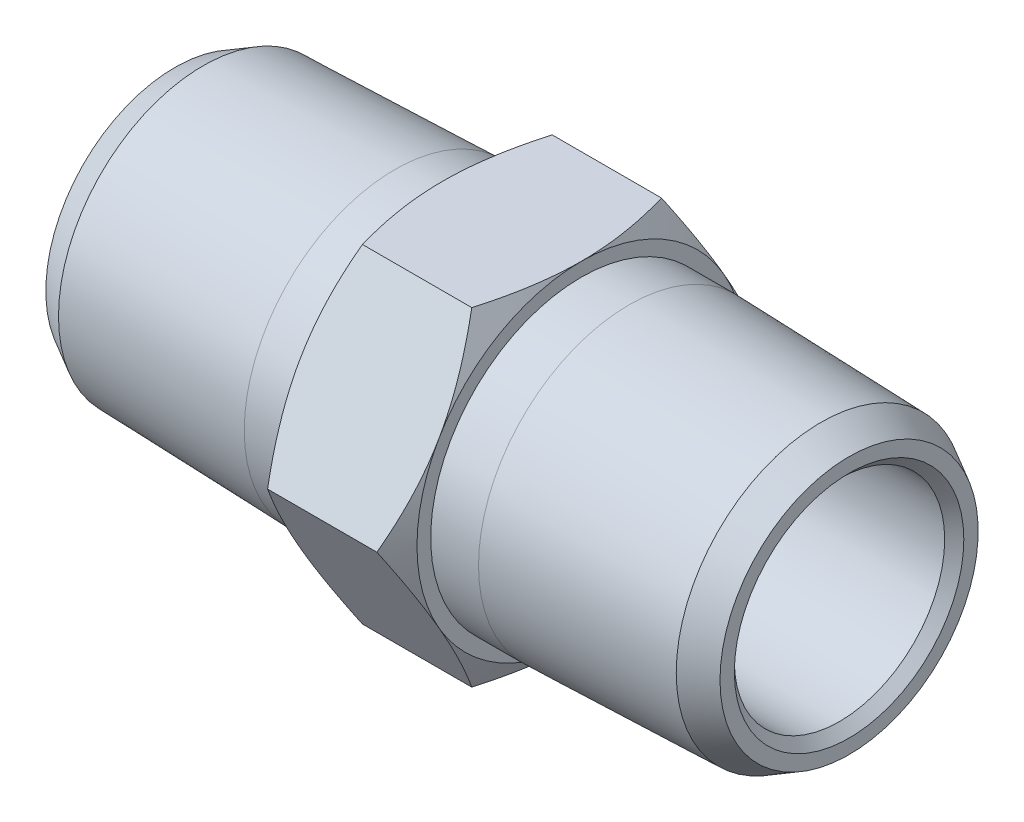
ISO-10303-21;
HEADER;
FILE_DESCRIPTION(('STEP AP214'),'2;1');
FILE_NAME('part.step','',(''),(''),'','','');
FILE_SCHEMA(('AUTOMOTIVE_DESIGN { 1 0 10303 214 1 1 1 1 }'));
ENDSEC;
DATA;
#1=APPLICATION_CONTEXT('core data for automotive mechanical design processes');
#2=APPLICATION_PROTOCOL_DEFINITION('international standard','automotive_design',2000,#1);
#3=PRODUCT_CONTEXT('',#1,'mechanical');
#4=PRODUCT('Part','Part','',(#3));
#5=PRODUCT_RELATED_PRODUCT_CATEGORY('part','',(#4));
#6=PRODUCT_DEFINITION_FORMATION('','',#4);
#7=PRODUCT_DEFINITION_CONTEXT('part definition',#1,'design');
#8=PRODUCT_DEFINITION('design','',#6,#7);
#9=PRODUCT_DEFINITION_SHAPE('','',#8);
#10=(LENGTH_UNIT() NAMED_UNIT(*) SI_UNIT(.MILLI.,.METRE.));
#11=(NAMED_UNIT(*) PLANE_ANGLE_UNIT() SI_UNIT($,.RADIAN.));
#12=(NAMED_UNIT(*) SI_UNIT($,.STERADIAN.) SOLID_ANGLE_UNIT());
#13=UNCERTAINTY_MEASURE_WITH_UNIT(LENGTH_MEASURE(1.E-05),#10,'distance_accuracy_value','');
#14=(GEOMETRIC_REPRESENTATION_CONTEXT(3) GLOBAL_UNCERTAINTY_ASSIGNED_CONTEXT((#13)) GLOBAL_UNIT_ASSIGNED_CONTEXT((#10,
#11,#12)) REPRESENTATION_CONTEXT('',''));
#15=CARTESIAN_POINT('',(0.,0.,0.));
#16=DIRECTION('',(0.,0.,1.));
#17=DIRECTION('',(1.,0.,0.));
#18=AXIS2_PLACEMENT_3D('',#15,#16,#17);
#19=CARTESIAN_POINT('',(0.,0.,-10.0819790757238));
#20=DIRECTION('',(0.,-0.5,-0.866025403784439));
#21=DIRECTION('',(0.,0.866025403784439,-0.5));
#22=AXIS2_PLACEMENT_3D('',#19,#20,#21);
#23=PLANE('',#22);
#24=CARTESIAN_POINT('',(-2.90315621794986,-2.16542185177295E-08,-10.0819790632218));
#25=CARTESIAN_POINT('',(-3.02163927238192,-0.355360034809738,-9.87681186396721));
#26=CARTESIAN_POINT('',(-3.13019043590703,-0.713565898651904,-9.67000161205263));
#27=CARTESIAN_POINT('',(-3.3216184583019,-1.43313517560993,-9.25455809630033));
#28=CARTESIAN_POINT('',(-3.40462227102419,-1.79447348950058,-9.04593932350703));
#29=CARTESIAN_POINT('',(-3.50653686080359,-2.33989111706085,-8.73104230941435));
#30=CARTESIAN_POINT('',(-3.536755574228,-2.52238597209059,-8.6256788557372));
#31=CARTESIAN_POINT('',(-3.58906479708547,-2.8882493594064,-8.41444753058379));
#32=CARTESIAN_POINT('',(-3.61115552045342,-3.07161786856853,-8.30857967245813));
#33=CARTESIAN_POINT('',(-3.64682062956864,-3.4399068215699,-8.09594794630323));
#34=CARTESIAN_POINT('',(-3.66035170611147,-3.62483043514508,-7.98918224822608));
#35=CARTESIAN_POINT('',(-3.67846012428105,-3.99504134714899,-7.77544087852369));
#36=CARTESIAN_POINT('',(-3.68303569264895,-4.18032871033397,-7.66846516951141));
#37=CARTESIAN_POINT('',(-3.68300000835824,-4.3656249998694,-7.56148430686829));
#38=B_SPLINE_CURVE_WITH_KNOTS('',3,(#24,#25,#26,#27,#28,#29,#30,#31,#32,#33,#34,#35,#36,#37),
.UNSPECIFIED.,.F.,.F.,(4,2,2,2,2,2,4),(0.,1.28181150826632,2.55714637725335,3.19565056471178,
3.83413794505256,4.47583056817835,5.1176502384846),.UNSPECIFIED.);
#39=CARTESIAN_POINT('',(-2.90315621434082,1.08271007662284E-08,-10.0819790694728));
#40=VERTEX_POINT('',#39);
#41=CARTESIAN_POINT('',(-3.68300000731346,-4.3656250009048,-7.56148430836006));
#42=VERTEX_POINT('',#41);
#43=EDGE_CURVE('E289',#40,#42,#38,.T.);
#44=ORIENTED_EDGE('',*,*,#43,.F.);
#45=DIRECTION('',(1.,0.,0.));
#46=VECTOR('',#45,1.);
#47=CARTESIAN_POINT('',(0.,0.,-10.0819790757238));
#48=LINE('',#47,#46);
#49=CARTESIAN_POINT('',(2.90315620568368,1.51443233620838E-08,-10.0819790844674));
#50=VERTEX_POINT('',#49);
#51=EDGE_CURVE('E134',#50,#40,#48,.F.);
#52=ORIENTED_EDGE('',*,*,#51,.F.);
#53=CARTESIAN_POINT('',(3.68300000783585,-4.3656249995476,-7.5614843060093));
#54=CARTESIAN_POINT('',(3.68303569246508,-4.18032870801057,-7.66846517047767));
#55=CARTESIAN_POINT('',(3.67846012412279,-3.99504134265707,-7.77544088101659));
#56=CARTESIAN_POINT('',(3.66035170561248,-3.62483042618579,-7.98918225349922));
#57=CARTESIAN_POINT('',(3.64682062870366,-3.43990681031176,-8.09594795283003));
#58=CARTESIAN_POINT('',(3.61115551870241,-3.07161785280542,-8.30857968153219));
#59=CARTESIAN_POINT('',(3.58906479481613,-2.8882493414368,-8.41444754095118));
#60=CARTESIAN_POINT('',(3.53675557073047,-2.52238594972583,-8.62567886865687));
#61=CARTESIAN_POINT('',(3.50653685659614,-2.33989109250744,-8.73104232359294));
#62=CARTESIAN_POINT('',(3.4046222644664,-1.79447345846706,-9.0459393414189));
#63=CARTESIAN_POINT('',(3.32161844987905,-1.43313514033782,-9.25455811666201));
#64=CARTESIAN_POINT('',(3.13019042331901,-0.713565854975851,-9.6700016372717));
#65=CARTESIAN_POINT('',(3.02163925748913,-0.355359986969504,-9.87681189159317));
#66=CARTESIAN_POINT('',(2.90315620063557,3.02886534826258E-08,-10.081979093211));
#67=B_SPLINE_CURVE_WITH_KNOTS('',3,(#53,#54,#55,#56,#57,#58,#59,#60,#61,#62,#63,#64,#65,#66),
.UNSPECIFIED.,.F.,.F.,(4,2,2,2,2,2,4),(0.,0.641819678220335,1.28351230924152,1.92199969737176,
2.56050389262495,3.83583877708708,5.11765030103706),.UNSPECIFIED.);
#68=CARTESIAN_POINT('',(3.68300000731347,-4.3656250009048,-7.56148430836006));
#69=VERTEX_POINT('',#68);
#70=EDGE_CURVE('E132',#69,#50,#67,.T.);
#71=ORIENTED_EDGE('',*,*,#70,.F.);
#72=CARTESIAN_POINT('',(2.90315623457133,-8.73124992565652,-5.04098957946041));
#73=CARTESIAN_POINT('',(3.02163928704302,-8.37588991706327,-5.2461567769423));
#74=CARTESIAN_POINT('',(3.1301904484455,-8.01768405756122,-5.45296702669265));
#75=CARTESIAN_POINT('',(3.32161846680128,-7.29811478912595,-5.86841053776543));
#76=CARTESIAN_POINT('',(3.4046222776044,-6.93677647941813,-6.07702930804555));
#77=CARTESIAN_POINT('',(3.50653686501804,-6.39135885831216,-6.39192631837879));
#78=CARTESIAN_POINT('',(3.53675557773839,-6.20886400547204,-6.49728977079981));
#79=CARTESIAN_POINT('',(3.58906479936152,-5.84300062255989,-6.70852109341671));
#80=CARTESIAN_POINT('',(3.61115552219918,-5.6596321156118,-6.81438895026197));
#81=CARTESIAN_POINT('',(3.64682063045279,-5.29134316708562,-7.02702067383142));
#82=CARTESIAN_POINT('',(3.66035170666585,-5.10641955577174,-7.13378637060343));
#83=CARTESIAN_POINT('',(3.67846012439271,-4.73620864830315,-7.34752773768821));
#84=CARTESIAN_POINT('',(3.68303569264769,-4.55092128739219,-7.45450344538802));
#85=CARTESIAN_POINT('',(3.68300000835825,-4.3656250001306,-7.56148430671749));
#86=B_SPLINE_CURVE_WITH_KNOTS('',3,(#72,#73,#74,#75,#76,#77,#78,#79,#80,#81,#82,#83,#84,#85),
.UNSPECIFIED.,.F.,.F.,(4,2,2,2,2,2,4),(0.,1.28181149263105,2.55714634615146,3.19565052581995,
3.83413789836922,4.47583051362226,5.11765017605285),.UNSPECIFIED.);
#87=CARTESIAN_POINT('',(2.90315620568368,-8.73125,-5.04098955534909));
#88=VERTEX_POINT('',#87);
#89=EDGE_CURVE('E20',#88,#69,#86,.T.);
#90=ORIENTED_EDGE('',*,*,#89,.F.);
#91=DIRECTION('',(1.,0.,0.));
#92=VECTOR('',#91,1.);
#93=CARTESIAN_POINT('',(0.,-8.73125,-5.04098953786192));
#94=LINE('',#93,#92);
#95=CARTESIAN_POINT('',(-2.90315622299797,-8.73124996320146,-5.04098955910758));
#96=VERTEX_POINT('',#95);
#97=EDGE_CURVE('E109',#96,#88,#94,.T.);
#98=ORIENTED_EDGE('',*,*,#97,.F.);
#99=CARTESIAN_POINT('',(-3.68300000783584,-4.3656249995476,-7.5614843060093));
#100=CARTESIAN_POINT('',(-3.68303569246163,-4.55092128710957,-7.45450344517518));
#101=CARTESIAN_POINT('',(-3.67846012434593,-4.73620864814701,-7.34752773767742));
#102=CARTESIAN_POINT('',(-3.66035170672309,-5.10641955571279,-7.13378637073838));
#103=CARTESIAN_POINT('',(-3.64682063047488,-5.29134316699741,-7.02702067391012));
#104=CARTESIAN_POINT('',(-3.61115552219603,-5.65963211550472,-6.81438895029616));
#105=CARTESIAN_POINT('',(-3.58906479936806,-5.84300062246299,-6.70852109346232));
#106=CARTESIAN_POINT('',(-3.53675557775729,-6.20886400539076,-6.49728977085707));
#107=CARTESIAN_POINT('',(-3.50653686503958,-6.39135885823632,-6.39192631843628));
#108=CARTESIAN_POINT('',(-3.40462227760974,-6.93677647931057,-6.07702930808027));
#109=CARTESIAN_POINT('',(-3.32161846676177,-7.29811478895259,-5.8684105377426));
#110=CARTESIAN_POINT('',(-3.13019044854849,-8.01768405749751,-5.45296702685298));
#111=CARTESIAN_POINT('',(-3.02163928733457,-8.37588991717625,-5.24615677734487));
#112=CARTESIAN_POINT('',(-2.90315623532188,-8.73124992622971,-5.04098958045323));
#113=B_SPLINE_CURVE_WITH_KNOTS('',3,(#99,#100,#101,#102,#103,#104,#105,#106,#107,#108,#109,#110,
#111,#112),.UNSPECIFIED.,.F.,.F.,(4,2,2,2,2,2,4),(0.,0.641819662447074,1.28351227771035,
1.9219996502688,2.56050382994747,3.83583868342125,5.11765017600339),.UNSPECIFIED.);
#114=EDGE_CURVE('E192',#42,#96,#113,.T.);
#115=ORIENTED_EDGE('',*,*,#114,.F.);
#116=EDGE_LOOP('',(#44,#52,#71,#90,#98,#115));
#117=FACE_BOUND('',#116,.T.);
#118=ADVANCED_FACE('F16',(#117),#23,.T.);
#119=CARTESIAN_POINT('',(0.,8.73125,-5.04098953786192));
#120=DIRECTION('',(0.,0.5,-0.866025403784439));
#121=DIRECTION('',(0.,0.866025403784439,0.5));
#122=AXIS2_PLACEMENT_3D('',#119,#120,#121);
#123=PLANE('',#122);
#124=CARTESIAN_POINT('',(-2.90315620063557,8.73125003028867,-5.04098952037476));
#125=CARTESIAN_POINT('',(-3.02163925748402,8.37589001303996,-5.24615672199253));
#126=CARTESIAN_POINT('',(-3.13019042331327,8.01768414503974,-5.45296697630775));
#127=CARTESIAN_POINT('',(-3.32161844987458,7.29811485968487,-5.86841049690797));
#128=CARTESIAN_POINT('',(-3.40462226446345,6.9367765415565,-6.07702927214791));
#129=CARTESIAN_POINT('',(-3.50653685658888,6.39135890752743,-6.39192628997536));
#130=CARTESIAN_POINT('',(-3.53675557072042,6.20886405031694,-6.49728974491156));
#131=CARTESIAN_POINT('',(-3.58906479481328,5.84300065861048,-6.70852107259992));
#132=CARTESIAN_POINT('',(-3.6111555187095,5.65963214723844,-6.81438893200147));
#133=CARTESIAN_POINT('',(-3.64682062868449,5.29134318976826,-7.02702066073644));
#134=CARTESIAN_POINT('',(-3.66035170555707,5.10641957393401,-7.13378636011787));
#135=CARTESIAN_POINT('',(-3.67846012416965,4.73620865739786,-7.34752773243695));
#136=CARTESIAN_POINT('',(-3.68303569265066,4.55092129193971,-7.45450344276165));
#137=CARTESIAN_POINT('',(-3.68300000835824,4.36562500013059,-7.56148430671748));
#138=B_SPLINE_CURVE_WITH_KNOTS('',3,(#124,#125,#126,#127,#128,#129,#130,#131,#132,#133,#134,
#135,#136,#137),.UNSPECIFIED.,.F.,.F.,(4,2,2,2,2,2,4),(0.,1.28181152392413,2.55714640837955,
3.19565060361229,3.834137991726,4.47583062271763,5.11765030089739),.UNSPECIFIED.);
#139=CARTESIAN_POINT('',(-2.90315622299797,8.73125,-5.04098949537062));
#140=VERTEX_POINT('',#139);
#141=CARTESIAN_POINT('',(-3.68300000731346,4.3656250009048,-7.56148430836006));
#142=VERTEX_POINT('',#141);
#143=EDGE_CURVE('E278',#140,#142,#138,.T.);
#144=ORIENTED_EDGE('',*,*,#143,.F.);
#145=DIRECTION('',(1.,0.,0.));
#146=VECTOR('',#145,1.);
#147=CARTESIAN_POINT('',(0.,8.73125,-5.04098953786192));
#148=LINE('',#147,#146);
#149=CARTESIAN_POINT('',(2.90315620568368,8.73125001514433,-5.04098952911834));
#150=VERTEX_POINT('',#149);
#151=EDGE_CURVE('E394',#150,#140,#148,.F.);
#152=ORIENTED_EDGE('',*,*,#151,.F.);
#153=CARTESIAN_POINT('',(3.68300000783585,4.3656249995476,-7.5614843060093));
#154=CARTESIAN_POINT('',(3.68303569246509,4.55092129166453,-7.45450344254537));
#155=CARTESIAN_POINT('',(3.67846012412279,4.73620865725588,-7.34752773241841));
#156=CARTESIAN_POINT('',(3.66035170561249,5.10641957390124,-7.13378636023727));
#157=CARTESIAN_POINT('',(3.64682062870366,5.29134318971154,-7.0270206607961));
#158=CARTESIAN_POINT('',(3.61115551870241,5.65963214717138,-6.8143889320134));
#159=CARTESIAN_POINT('',(3.58906479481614,5.84300065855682,-6.70852107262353));
#160=CARTESIAN_POINT('',(3.53675557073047,6.20886405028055,-6.49728974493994));
#161=CARTESIAN_POINT('',(3.50653685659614,6.39135890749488,-6.39192628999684));
#162=CARTESIAN_POINT('',(3.40462226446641,6.93677654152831,-6.07702927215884));
#163=CARTESIAN_POINT('',(3.32161844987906,7.29811485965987,-5.86841049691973));
#164=CARTESIAN_POINT('',(3.13019042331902,8.01768414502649,-5.4529669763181));
#165=CARTESIAN_POINT('',(3.02163925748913,8.37589001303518,-5.24615672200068));
#166=CARTESIAN_POINT('',(2.90315620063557,8.73125003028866,-5.04098952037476));
#167=B_SPLINE_CURVE_WITH_KNOTS('',3,(#153,#154,#155,#156,#157,#158,#159,#160,#161,#162,#163,
#164,#165,#166),.UNSPECIFIED.,.F.,.F.,(4,2,2,2,2,2,4),(0.,0.641819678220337,1.28351230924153,
1.92199969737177,2.56050389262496,3.8358387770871,5.11765030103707),.UNSPECIFIED.);
#168=CARTESIAN_POINT('',(3.68300000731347,4.3656250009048,-7.56148430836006));
#169=VERTEX_POINT('',#168);
#170=EDGE_CURVE('E327',#169,#150,#167,.T.);
#171=ORIENTED_EDGE('',*,*,#170,.F.);
#172=CARTESIAN_POINT('',(2.90315623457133,7.31970769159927E-08,-10.0819790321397));
#173=CARTESIAN_POINT('',(3.02163928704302,0.355360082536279,-9.87681183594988));
#174=CARTESIAN_POINT('',(3.13019044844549,0.713565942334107,-9.67000158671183));
#175=CARTESIAN_POINT('',(3.32161846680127,1.43313521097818,-9.2545580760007));
#176=CARTESIAN_POINT('',(3.40462227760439,1.79447352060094,-9.04593930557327));
#177=CARTESIAN_POINT('',(3.50653686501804,2.33989114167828,-8.73104229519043));
#178=CARTESIAN_POINT('',(3.53675557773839,2.52238599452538,-8.62567884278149));
#179=CARTESIAN_POINT('',(3.58906479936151,2.88824937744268,-8.41444752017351));
#180=CARTESIAN_POINT('',(3.61115552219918,3.07161788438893,-8.30857966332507));
#181=CARTESIAN_POINT('',(3.64682063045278,3.43990683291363,-8.09594793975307));
#182=CARTESIAN_POINT('',(3.66035170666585,3.62483044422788,-7.98918224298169));
#183=CARTESIAN_POINT('',(3.6784601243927,3.99504135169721,-7.77544087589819));
#184=CARTESIAN_POINT('',(3.68303569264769,4.18032871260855,-7.66846516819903));
#185=CARTESIAN_POINT('',(3.68300000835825,4.3656249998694,-7.56148430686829));
#186=B_SPLINE_CURVE_WITH_KNOTS('',3,(#172,#173,#174,#175,#176,#177,#178,#179,#180,#181,#182,
#183,#184,#185),.UNSPECIFIED.,.F.,.F.,(4,2,2,2,2,2,4),(0.,1.28181149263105,2.55714634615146,
3.19565052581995,3.83413789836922,4.47583051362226,5.11765017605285),.UNSPECIFIED.);
#187=EDGE_CURVE('E128',#50,#169,#186,.T.);
#188=ORIENTED_EDGE('',*,*,#187,.F.);
#189=ORIENTED_EDGE('',*,*,#51,.T.);
#190=CARTESIAN_POINT('',(-3.68300000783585,4.3656249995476,-7.5614843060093));
#191=CARTESIAN_POINT('',(-3.68303569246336,4.18032871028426,-7.66846516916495));
#192=CARTESIAN_POINT('',(-3.67846012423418,3.99504134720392,-7.77544087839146));
#193=CARTESIAN_POINT('',(-3.66035170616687,3.62483043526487,-7.98918224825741));
#194=CARTESIAN_POINT('',(-3.6468206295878,3.43990682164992,-8.09594794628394));
#195=CARTESIAN_POINT('',(-3.61115552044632,3.0716178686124,-8.30857967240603));
#196=CARTESIAN_POINT('',(-3.58906479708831,2.88824935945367,-8.41444753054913));
#197=CARTESIAN_POINT('',(-3.53675557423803,2.52238597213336,-8.62567885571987));
#198=CARTESIAN_POINT('',(-3.50653686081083,2.33989111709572,-8.73104230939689));
#199=CARTESIAN_POINT('',(-3.40462227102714,1.79447348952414,-9.04593932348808));
#200=CARTESIAN_POINT('',(-3.32161845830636,1.4331351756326,-9.25455809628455));
#201=CARTESIAN_POINT('',(-3.13019043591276,0.713565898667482,-9.67000161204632));
#202=CARTESIAN_POINT('',(-3.02163927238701,0.35536003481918,-9.87681186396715));
#203=CARTESIAN_POINT('',(-2.90315621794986,2.16542089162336E-08,-10.0819790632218));
#204=B_SPLINE_CURVE_WITH_KNOTS('',3,(#190,#191,#192,#193,#194,#195,#196,#197,#198,#199,#200,
#201,#202,#203),.UNSPECIFIED.,.F.,.F.,(4,2,2,2,2,2,4),(0.,0.641819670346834,1.28351229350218,
1.92199967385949,2.56050386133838,3.83583873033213,5.1176502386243),.UNSPECIFIED.);
#205=EDGE_CURVE('E293',#142,#40,#204,.T.);
#206=ORIENTED_EDGE('',*,*,#205,.F.);
#207=EDGE_LOOP('',(#144,#152,#171,#188,#189,#206));
#208=FACE_BOUND('',#207,.T.);
#209=ADVANCED_FACE('F300',(#208),#123,.T.);
#210=CARTESIAN_POINT('',(0.,8.73125,5.04098953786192));
#211=DIRECTION('',(0.,1.,0.));
#212=DIRECTION('',(0.,0.,1.));
#213=AXIS2_PLACEMENT_3D('',#210,#211,#212);
#214=PLANE('',#213);
#215=CARTESIAN_POINT('',(-2.90315623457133,8.7312499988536,5.04098945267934));
#216=CARTESIAN_POINT('',(-3.02163928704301,8.73124999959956,4.63065505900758));
#217=CARTESIAN_POINT('',(-3.13019044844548,8.73124999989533,4.21703456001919));
#218=CARTESIAN_POINT('',(-3.32161846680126,8.73125000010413,3.38614753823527));
#219=CARTESIAN_POINT('',(-3.40462227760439,8.73125000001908,2.96890999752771));
#220=CARTESIAN_POINT('',(-3.50653686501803,8.73124999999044,2.33911597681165));
#221=CARTESIAN_POINT('',(-3.53675557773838,8.73124999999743,2.12838907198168));
#222=CARTESIAN_POINT('',(-3.5890647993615,8.73125000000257,1.7059264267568));
#223=CARTESIAN_POINT('',(-3.61115552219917,8.73125000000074,1.49419071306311));
#224=CARTESIAN_POINT('',(-3.64682063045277,8.73124999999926,1.06892726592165));
#225=CARTESIAN_POINT('',(-3.66035170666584,8.73124999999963,0.855395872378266));
#226=CARTESIAN_POINT('',(-3.67846012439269,8.73125000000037,0.427913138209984));
#227=CARTESIAN_POINT('',(-3.68303569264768,8.73125000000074,0.213961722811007));
#228=CARTESIAN_POINT('',(-3.68300000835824,8.73125,1.50800647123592E-10));
#229=B_SPLINE_CURVE_WITH_KNOTS('',3,(#215,#216,#217,#218,#219,#220,#221,#222,#223,#224,#225,
#226,#227,#228),.UNSPECIFIED.,.F.,.F.,(4,2,2,2,2,2,4),(0.,1.28181149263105,2.55714634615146,
3.19565052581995,3.83413789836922,4.47583051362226,5.11765017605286),.UNSPECIFIED.);
#230=CARTESIAN_POINT('',(-2.90315620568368,8.73125001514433,5.04098952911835));
#231=VERTEX_POINT('',#230);
#232=CARTESIAN_POINT('',(-3.68300000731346,8.73125000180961,0.));
#233=VERTEX_POINT('',#232);
#234=EDGE_CURVE('E258',#231,#233,#229,.T.);
#235=ORIENTED_EDGE('',*,*,#234,.F.);
#236=DIRECTION('',(1.,0.,0.));
#237=VECTOR('',#236,1.);
#238=CARTESIAN_POINT('',(0.,8.73125,5.04098953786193));
#239=LINE('',#238,#237);
#240=CARTESIAN_POINT('',(2.90315622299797,8.73125,5.04098949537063));
#241=VERTEX_POINT('',#240);
#242=EDGE_CURVE('E396',#241,#231,#239,.F.);
#243=ORIENTED_EDGE('',*,*,#242,.F.);
#244=CARTESIAN_POINT('',(3.68300000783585,8.73124999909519,0.));
#245=CARTESIAN_POINT('',(3.68303569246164,8.73124999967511,0.213961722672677));
#246=CARTESIAN_POINT('',(3.67846012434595,8.73124999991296,0.427913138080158));
#247=CARTESIAN_POINT('',(3.66035170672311,8.73125000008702,0.855395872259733));
#248=CARTESIAN_POINT('',(3.6468206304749,8.73125000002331,1.06892726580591));
#249=CARTESIAN_POINT('',(3.61115552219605,8.73124999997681,1.49419071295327));
#250=CARTESIAN_POINT('',(3.58906479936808,8.73124999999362,1.70592642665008));
#251=CARTESIAN_POINT('',(3.5367555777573,8.73125000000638,2.12838907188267));
#252=CARTESIAN_POINT('',(3.50653686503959,8.73125000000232,2.33911597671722));
#253=CARTESIAN_POINT('',(3.40462227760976,8.73124999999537,2.96890999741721));
#254=CARTESIAN_POINT('',(3.32161846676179,8.73124999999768,3.38614753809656));
#255=CARTESIAN_POINT('',(3.1301904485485,8.73125000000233,4.21703455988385));
#256=CARTESIAN_POINT('',(3.02163928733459,8.73125000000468,4.63065505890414));
#257=CARTESIAN_POINT('',(2.90315623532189,8.73125,5.04098945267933));
#258=B_SPLINE_CURVE_WITH_KNOTS('',3,(#244,#245,#246,#247,#248,#249,#250,#251,#252,#253,#254,
#255,#256,#257),.UNSPECIFIED.,.F.,.F.,(4,2,2,2,2,2,4),(0.,0.641819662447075,1.28351227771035,
1.92199965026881,2.56050382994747,3.83583868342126,5.11765017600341),.UNSPECIFIED.);
#259=CARTESIAN_POINT('',(3.68300000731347,8.73125000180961,0.));
#260=VERTEX_POINT('',#259);
#261=EDGE_CURVE('E332',#260,#241,#258,.T.);
#262=ORIENTED_EDGE('',*,*,#261,.F.);
#263=CARTESIAN_POINT('',(2.90315623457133,8.7312499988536,-5.04098945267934));
#264=CARTESIAN_POINT('',(3.02163928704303,8.73124999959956,-4.63065505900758));
#265=CARTESIAN_POINT('',(3.1301904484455,8.73124999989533,-4.2170345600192));
#266=CARTESIAN_POINT('',(3.32161846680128,8.73125000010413,-3.38614753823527));
#267=CARTESIAN_POINT('',(3.4046222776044,8.73125000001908,-2.96890999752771));
#268=CARTESIAN_POINT('',(3.50653686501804,8.73124999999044,-2.33911597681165));
#269=CARTESIAN_POINT('',(3.53675557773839,8.73124999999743,-2.12838907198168));
#270=CARTESIAN_POINT('',(3.58906479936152,8.73125000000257,-1.7059264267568));
#271=CARTESIAN_POINT('',(3.61115552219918,8.73125000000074,-1.49419071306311));
#272=CARTESIAN_POINT('',(3.64682063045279,8.73124999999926,-1.06892726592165));
#273=CARTESIAN_POINT('',(3.66035170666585,8.73124999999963,-0.855395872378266));
#274=CARTESIAN_POINT('',(3.67846012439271,8.73125000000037,-0.427913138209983));
#275=CARTESIAN_POINT('',(3.68303569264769,8.73125000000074,-0.213961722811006));
#276=CARTESIAN_POINT('',(3.68300000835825,8.73125,-1.50799381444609E-10));
#277=B_SPLINE_CURVE_WITH_KNOTS('',3,(#263,#264,#265,#266,#267,#268,#269,#270,#271,#272,#273,
#274,#275,#276),.UNSPECIFIED.,.F.,.F.,(4,2,2,2,2,2,4),(0.,1.28181149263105,2.55714634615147,
3.19565052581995,3.83413789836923,4.47583051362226,5.11765017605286),.UNSPECIFIED.);
#278=EDGE_CURVE('E137',#150,#260,#277,.T.);
#279=ORIENTED_EDGE('',*,*,#278,.F.);
#280=ORIENTED_EDGE('',*,*,#151,.T.);
#281=CARTESIAN_POINT('',(-3.68300000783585,8.7312499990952,0.));
#282=CARTESIAN_POINT('',(-3.68303569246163,8.73124999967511,-0.213961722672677));
#283=CARTESIAN_POINT('',(-3.67846012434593,8.73124999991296,-0.427913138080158));
#284=CARTESIAN_POINT('',(-3.6603517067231,8.73125000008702,-0.855395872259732));
#285=CARTESIAN_POINT('',(-3.64682063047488,8.73125000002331,-1.06892726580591));
#286=CARTESIAN_POINT('',(-3.61115552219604,8.73124999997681,-1.49419071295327));
#287=CARTESIAN_POINT('',(-3.58906479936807,8.73124999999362,-1.70592642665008));
#288=CARTESIAN_POINT('',(-3.53675557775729,8.73125000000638,-2.12838907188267));
#289=CARTESIAN_POINT('',(-3.50653686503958,8.73125000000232,-2.33911597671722));
#290=CARTESIAN_POINT('',(-3.40462227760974,8.73124999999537,-2.96890999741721));
#291=CARTESIAN_POINT('',(-3.32161846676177,8.73124999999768,-3.38614753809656));
#292=CARTESIAN_POINT('',(-3.13019044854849,8.73125000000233,-4.21703455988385));
#293=CARTESIAN_POINT('',(-3.02163928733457,8.73125000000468,-4.63065505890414));
#294=CARTESIAN_POINT('',(-2.90315623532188,8.73125,-5.04098945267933));
#295=B_SPLINE_CURVE_WITH_KNOTS('',3,(#281,#282,#283,#284,#285,#286,#287,#288,#289,#290,#291,
#292,#293,#294),.UNSPECIFIED.,.F.,.F.,(4,2,2,2,2,2,4),(0.,0.641819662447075,1.28351227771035,
1.92199965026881,2.56050382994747,3.83583868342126,5.11765017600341),.UNSPECIFIED.);
#296=EDGE_CURVE('E283',#233,#140,#295,.T.);
#297=ORIENTED_EDGE('',*,*,#296,.F.);
#298=EDGE_LOOP('',(#235,#243,#262,#279,#280,#297));
#299=FACE_BOUND('',#298,.T.);
#300=ADVANCED_FACE('F238',(#299),#214,.T.);
#301=CARTESIAN_POINT('',(0.,0.,10.0819790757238));
#302=DIRECTION('',(0.,0.5,0.866025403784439));
#303=DIRECTION('',(0.,-0.866025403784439,0.5));
#304=AXIS2_PLACEMENT_3D('',#301,#302,#303);
#305=PLANE('',#304);
#306=DIRECTION('',(1.,0.,0.));
#307=VECTOR('',#306,1.);
#308=CARTESIAN_POINT('',(0.,0.,10.0819790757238));
#309=LINE('',#308,#307);
#310=CARTESIAN_POINT('',(2.90315621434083,1.08271121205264E-08,10.0819790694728));
#311=VERTEX_POINT('',#310);
#312=CARTESIAN_POINT('',(-2.90315620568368,1.51443349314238E-08,10.0819790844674));
#313=VERTEX_POINT('',#312);
#314=EDGE_CURVE('E351',#311,#313,#309,.F.);
#315=ORIENTED_EDGE('',*,*,#314,.F.);
#316=CARTESIAN_POINT('',(3.68300000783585,4.3656249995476,7.56148430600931));
#317=CARTESIAN_POINT('',(3.68303569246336,4.18032871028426,7.66846516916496));
#318=CARTESIAN_POINT('',(3.67846012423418,3.99504134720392,7.77544087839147));
#319=CARTESIAN_POINT('',(3.66035170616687,3.62483043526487,7.98918224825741));
#320=CARTESIAN_POINT('',(3.6468206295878,3.43990682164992,8.09594794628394));
#321=CARTESIAN_POINT('',(3.61115552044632,3.0716178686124,8.30857967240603));
#322=CARTESIAN_POINT('',(3.58906479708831,2.88824935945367,8.41444753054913));
#323=CARTESIAN_POINT('',(3.53675557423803,2.52238597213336,8.62567885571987));
#324=CARTESIAN_POINT('',(3.50653686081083,2.33989111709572,8.73104230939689));
#325=CARTESIAN_POINT('',(3.40462227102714,1.79447348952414,9.04593932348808));
#326=CARTESIAN_POINT('',(3.32161845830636,1.4331351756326,9.25455809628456));
#327=CARTESIAN_POINT('',(3.13019043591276,0.713565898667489,9.67000161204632));
#328=CARTESIAN_POINT('',(3.02163927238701,0.355360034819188,9.87681186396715));
#329=CARTESIAN_POINT('',(2.90315621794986,2.16542181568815E-08,10.0819790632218));
#330=B_SPLINE_CURVE_WITH_KNOTS('',3,(#316,#317,#318,#319,#320,#321,#322,#323,#324,#325,#326,
#327,#328,#329),.UNSPECIFIED.,.F.,.F.,(4,2,2,2,2,2,4),(0.,0.641819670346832,1.28351229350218,
1.92199967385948,2.56050386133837,3.83583873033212,5.11765023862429),.UNSPECIFIED.);
#331=CARTESIAN_POINT('',(3.68300000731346,4.3656250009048,7.56148430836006));
#332=VERTEX_POINT('',#331);
#333=EDGE_CURVE('E224',#332,#311,#330,.T.);
#334=ORIENTED_EDGE('',*,*,#333,.F.);
#335=CARTESIAN_POINT('',(2.90315620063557,8.73125003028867,5.04098952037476));
#336=CARTESIAN_POINT('',(3.02163925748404,8.37589001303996,5.24615672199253));
#337=CARTESIAN_POINT('',(3.13019042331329,8.01768414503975,5.45296697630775));
#338=CARTESIAN_POINT('',(3.32161844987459,7.29811485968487,5.86841049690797));
#339=CARTESIAN_POINT('',(3.40462226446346,6.93677654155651,6.07702927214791));
#340=CARTESIAN_POINT('',(3.50653685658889,6.39135890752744,6.39192628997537));
#341=CARTESIAN_POINT('',(3.53675557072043,6.20886405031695,6.49728974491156));
#342=CARTESIAN_POINT('',(3.5890647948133,5.84300065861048,6.70852107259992));
#343=CARTESIAN_POINT('',(3.61115551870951,5.65963214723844,6.81438893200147));
#344=CARTESIAN_POINT('',(3.64682062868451,5.29134318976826,7.02702066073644));
#345=CARTESIAN_POINT('',(3.66035170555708,5.10641957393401,7.13378636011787));
#346=CARTESIAN_POINT('',(3.67846012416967,4.73620865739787,7.34752773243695));
#347=CARTESIAN_POINT('',(3.68303569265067,4.55092129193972,7.45450344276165));
#348=CARTESIAN_POINT('',(3.68300000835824,4.3656250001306,7.56148430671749));
#349=B_SPLINE_CURVE_WITH_KNOTS('',3,(#335,#336,#337,#338,#339,#340,#341,#342,#343,#344,#345,
#346,#347,#348),.UNSPECIFIED.,.F.,.F.,(4,2,2,2,2,2,4),(0.,1.28181152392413,2.55714640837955,
3.19565060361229,3.834137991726,4.47583062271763,5.11765030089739),.UNSPECIFIED.);
#350=EDGE_CURVE('E229',#241,#332,#349,.T.);
#351=ORIENTED_EDGE('',*,*,#350,.F.);
#352=ORIENTED_EDGE('',*,*,#242,.T.);
#353=CARTESIAN_POINT('',(-3.68300000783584,4.3656249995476,7.5614843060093));
#354=CARTESIAN_POINT('',(-3.68303569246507,4.55092129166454,7.45450344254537));
#355=CARTESIAN_POINT('',(-3.67846012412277,4.73620865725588,7.34752773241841));
#356=CARTESIAN_POINT('',(-3.66035170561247,5.10641957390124,7.13378636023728));
#357=CARTESIAN_POINT('',(-3.64682062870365,5.29134318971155,7.0270206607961));
#358=CARTESIAN_POINT('',(-3.6111555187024,5.65963214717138,6.81438893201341));
#359=CARTESIAN_POINT('',(-3.58906479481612,5.84300065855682,6.70852107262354));
#360=CARTESIAN_POINT('',(-3.53675557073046,6.20886405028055,6.49728974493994));
#361=CARTESIAN_POINT('',(-3.50653685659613,6.39135890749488,6.39192628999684));
#362=CARTESIAN_POINT('',(-3.40462226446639,6.93677654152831,6.07702927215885));
#363=CARTESIAN_POINT('',(-3.32161844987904,7.29811485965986,5.86841049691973));
#364=CARTESIAN_POINT('',(-3.130190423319,8.01768414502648,5.4529669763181));
#365=CARTESIAN_POINT('',(-3.02163925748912,8.37589001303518,5.24615672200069));
#366=CARTESIAN_POINT('',(-2.90315620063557,8.73125003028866,5.04098952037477));
#367=B_SPLINE_CURVE_WITH_KNOTS('',3,(#353,#354,#355,#356,#357,#358,#359,#360,#361,#362,#363,
#364,#365,#366),.UNSPECIFIED.,.F.,.F.,(4,2,2,2,2,2,4),(0.,0.641819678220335,1.28351230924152,
1.92199969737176,2.56050389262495,3.83583877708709,5.11765030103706),.UNSPECIFIED.);
#368=CARTESIAN_POINT('',(-3.68300000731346,4.36562500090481,7.56148430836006));
#369=VERTEX_POINT('',#368);
#370=EDGE_CURVE('E251',#369,#231,#367,.T.);
#371=ORIENTED_EDGE('',*,*,#370,.F.);
#372=CARTESIAN_POINT('',(-2.90315623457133,7.31970879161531E-08,10.0819790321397));
#373=CARTESIAN_POINT('',(-3.02163928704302,0.355360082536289,9.87681183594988));
#374=CARTESIAN_POINT('',(-3.13019044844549,0.713565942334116,9.67000158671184));
#375=CARTESIAN_POINT('',(-3.32161846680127,1.43313521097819,9.2545580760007));
#376=CARTESIAN_POINT('',(-3.40462227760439,1.79447352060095,9.04593930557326));
#377=CARTESIAN_POINT('',(-3.50653686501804,2.33989114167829,8.73104229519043));
#378=CARTESIAN_POINT('',(-3.53675557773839,2.52238599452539,8.62567884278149));
#379=CARTESIAN_POINT('',(-3.58906479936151,2.88824937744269,8.41444752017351));
#380=CARTESIAN_POINT('',(-3.61115552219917,3.07161788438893,8.30857966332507));
#381=CARTESIAN_POINT('',(-3.64682063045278,3.43990683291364,8.09594793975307));
#382=CARTESIAN_POINT('',(-3.66035170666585,3.62483044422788,7.98918224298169));
#383=CARTESIAN_POINT('',(-3.6784601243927,3.99504135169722,7.7754408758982));
#384=CARTESIAN_POINT('',(-3.68303569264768,4.18032871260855,7.66846516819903));
#385=CARTESIAN_POINT('',(-3.68300000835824,4.3656249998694,7.56148430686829));
#386=B_SPLINE_CURVE_WITH_KNOTS('',3,(#372,#373,#374,#375,#376,#377,#378,#379,#380,#381,#382,
#383,#384,#385),.UNSPECIFIED.,.F.,.F.,(4,2,2,2,2,2,4),(0.,1.28181149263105,2.55714634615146,
3.19565052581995,3.83413789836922,4.47583051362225,5.11765017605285),.UNSPECIFIED.);
#387=EDGE_CURVE('E246',#313,#369,#386,.T.);
#388=ORIENTED_EDGE('',*,*,#387,.F.);
#389=EDGE_LOOP('',(#315,#334,#351,#352,#371,#388));
#390=FACE_BOUND('',#389,.T.);
#391=ADVANCED_FACE('F234',(#390),#305,.T.);
#392=CARTESIAN_POINT('',(0.,-8.73125,5.04098953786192));
#393=DIRECTION('',(0.,-0.5,0.866025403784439));
#394=DIRECTION('',(0.,-0.866025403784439,-0.5));
#395=AXIS2_PLACEMENT_3D('',#392,#393,#394);
#396=PLANE('',#395);
#397=DIRECTION('',(1.,0.,0.));
#398=VECTOR('',#397,1.);
#399=CARTESIAN_POINT('',(0.,-8.73125,5.04098953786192));
#400=LINE('',#399,#398);
#401=CARTESIAN_POINT('',(2.90315622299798,-8.73124996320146,5.04098955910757));
#402=VERTEX_POINT('',#401);
#403=CARTESIAN_POINT('',(-2.90315620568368,-8.73125,5.04098955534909));
#404=VERTEX_POINT('',#403);
#405=EDGE_CURVE('E120',#402,#404,#400,.F.);
#406=ORIENTED_EDGE('',*,*,#405,.F.);
#407=CARTESIAN_POINT('',(3.68300000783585,-4.3656249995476,7.5614843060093));
#408=CARTESIAN_POINT('',(3.68303569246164,-4.55092128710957,7.45450344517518));
#409=CARTESIAN_POINT('',(3.67846012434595,-4.73620864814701,7.34752773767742));
#410=CARTESIAN_POINT('',(3.66035170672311,-5.10641955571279,7.13378637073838));
#411=CARTESIAN_POINT('',(3.6468206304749,-5.29134316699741,7.02702067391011));
#412=CARTESIAN_POINT('',(3.61115552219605,-5.65963211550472,6.81438895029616));
#413=CARTESIAN_POINT('',(3.58906479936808,-5.84300062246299,6.70852109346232));
#414=CARTESIAN_POINT('',(3.5367555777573,-6.20886400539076,6.49728977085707));
#415=CARTESIAN_POINT('',(3.50653686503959,-6.39135885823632,6.39192631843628));
#416=CARTESIAN_POINT('',(3.40462227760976,-6.93677647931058,6.07702930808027));
#417=CARTESIAN_POINT('',(3.32161846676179,-7.29811478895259,5.86841053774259));
#418=CARTESIAN_POINT('',(3.1301904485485,-8.01768405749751,5.45296702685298));
#419=CARTESIAN_POINT('',(3.02163928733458,-8.37588991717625,5.24615677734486));
#420=CARTESIAN_POINT('',(2.90315623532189,-8.73124992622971,5.04098958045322));
#421=B_SPLINE_CURVE_WITH_KNOTS('',3,(#407,#408,#409,#410,#411,#412,#413,#414,#415,#416,#417,
#418,#419,#420),.UNSPECIFIED.,.F.,.F.,(4,2,2,2,2,2,4),(0.,0.641819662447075,1.28351227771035,
1.92199965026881,2.56050382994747,3.83583868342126,5.11765017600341),.UNSPECIFIED.);
#422=CARTESIAN_POINT('',(3.68300000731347,-4.3656250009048,7.56148430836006));
#423=VERTEX_POINT('',#422);
#424=EDGE_CURVE('E193',#423,#402,#421,.T.);
#425=ORIENTED_EDGE('',*,*,#424,.F.);
#426=CARTESIAN_POINT('',(2.90315621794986,-2.16542090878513E-08,10.0819790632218));
#427=CARTESIAN_POINT('',(3.02163927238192,-0.35536003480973,9.87681186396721));
#428=CARTESIAN_POINT('',(3.13019043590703,-0.713565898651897,9.67000161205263));
#429=CARTESIAN_POINT('',(3.3216184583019,-1.43313517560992,9.25455809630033));
#430=CARTESIAN_POINT('',(3.4046222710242,-1.79447348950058,9.04593932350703));
#431=CARTESIAN_POINT('',(3.50653686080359,-2.33989111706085,8.73104230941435));
#432=CARTESIAN_POINT('',(3.536755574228,-2.52238597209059,8.6256788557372));
#433=CARTESIAN_POINT('',(3.58906479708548,-2.8882493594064,8.41444753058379));
#434=CARTESIAN_POINT('',(3.61115552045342,-3.07161786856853,8.30857967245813));
#435=CARTESIAN_POINT('',(3.64682062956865,-3.4399068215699,8.09594794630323));
#436=CARTESIAN_POINT('',(3.66035170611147,-3.62483043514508,7.98918224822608));
#437=CARTESIAN_POINT('',(3.67846012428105,-3.99504134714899,7.77544087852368));
#438=CARTESIAN_POINT('',(3.68303569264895,-4.18032871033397,7.6684651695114));
#439=CARTESIAN_POINT('',(3.68300000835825,-4.3656249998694,7.56148430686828));
#440=B_SPLINE_CURVE_WITH_KNOTS('',3,(#426,#427,#428,#429,#430,#431,#432,#433,#434,#435,#436,
#437,#438,#439),.UNSPECIFIED.,.F.,.F.,(4,2,2,2,2,2,4),(0.,1.28181150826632,2.55714637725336,
3.19565056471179,3.83413794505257,4.47583056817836,5.11765023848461),.UNSPECIFIED.);
#441=EDGE_CURVE('E219',#311,#423,#440,.T.);
#442=ORIENTED_EDGE('',*,*,#441,.F.);
#443=ORIENTED_EDGE('',*,*,#314,.T.);
#444=CARTESIAN_POINT('',(-3.68300000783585,-4.3656249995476,7.5614843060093));
#445=CARTESIAN_POINT('',(-3.68303569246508,-4.18032870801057,7.66846517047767));
#446=CARTESIAN_POINT('',(-3.67846012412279,-3.99504134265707,7.77544088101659));
#447=CARTESIAN_POINT('',(-3.66035170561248,-3.62483042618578,7.98918225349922));
#448=CARTESIAN_POINT('',(-3.64682062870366,-3.43990681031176,8.09594795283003));
#449=CARTESIAN_POINT('',(-3.61115551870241,-3.07161785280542,8.30857968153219));
#450=CARTESIAN_POINT('',(-3.58906479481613,-2.88824934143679,8.41444754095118));
#451=CARTESIAN_POINT('',(-3.53675557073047,-2.52238594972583,8.62567886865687));
#452=CARTESIAN_POINT('',(-3.50653685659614,-2.33989109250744,8.73104232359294));
#453=CARTESIAN_POINT('',(-3.4046222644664,-1.79447345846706,9.0459393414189));
#454=CARTESIAN_POINT('',(-3.32161844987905,-1.43313514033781,9.25455811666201));
#455=CARTESIAN_POINT('',(-3.13019042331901,-0.713565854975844,9.6700016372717));
#456=CARTESIAN_POINT('',(-3.02163925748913,-0.355359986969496,9.87681189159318));
#457=CARTESIAN_POINT('',(-2.90315620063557,3.02886635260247E-08,10.081979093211));
#458=B_SPLINE_CURVE_WITH_KNOTS('',3,(#444,#445,#446,#447,#448,#449,#450,#451,#452,#453,#454,
#455,#456,#457),.UNSPECIFIED.,.F.,.F.,(4,2,2,2,2,2,4),(0.,0.641819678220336,1.28351230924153,
1.92199969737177,2.56050389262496,3.83583877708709,5.11765030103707),.UNSPECIFIED.);
#459=CARTESIAN_POINT('',(-3.68300000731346,-4.3656250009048,7.56148430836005));
#460=VERTEX_POINT('',#459);
#461=EDGE_CURVE('E687',#460,#313,#458,.T.);
#462=ORIENTED_EDGE('',*,*,#461,.F.);
#463=CARTESIAN_POINT('',(-2.90315623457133,-8.73124992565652,5.04098957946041));
#464=CARTESIAN_POINT('',(-3.02163928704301,-8.37588991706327,5.2461567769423));
#465=CARTESIAN_POINT('',(-3.13019044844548,-8.01768405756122,5.45296702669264));
#466=CARTESIAN_POINT('',(-3.32161846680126,-7.29811478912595,5.86841053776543));
#467=CARTESIAN_POINT('',(-3.40462227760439,-6.93677647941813,6.07702930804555));
#468=CARTESIAN_POINT('',(-3.50653686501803,-6.39135885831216,6.39192631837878));
#469=CARTESIAN_POINT('',(-3.53675557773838,-6.20886400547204,6.49728977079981));
#470=CARTESIAN_POINT('',(-3.5890647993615,-5.84300062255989,6.70852109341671));
#471=CARTESIAN_POINT('',(-3.61115552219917,-5.6596321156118,6.81438895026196));
#472=CARTESIAN_POINT('',(-3.64682063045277,-5.29134316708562,7.02702067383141));
#473=CARTESIAN_POINT('',(-3.66035170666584,-5.10641955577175,7.13378637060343));
#474=CARTESIAN_POINT('',(-3.67846012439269,-4.73620864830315,7.34752773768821));
#475=CARTESIAN_POINT('',(-3.68303569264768,-4.55092128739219,7.45450344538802));
#476=CARTESIAN_POINT('',(-3.68300000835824,-4.3656250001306,7.56148430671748));
#477=B_SPLINE_CURVE_WITH_KNOTS('',3,(#463,#464,#465,#466,#467,#468,#469,#470,#471,#472,#473,
#474,#475,#476),.UNSPECIFIED.,.F.,.F.,(4,2,2,2,2,2,4),(0.,1.28181149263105,2.55714634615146,
3.19565052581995,3.83413789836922,4.47583051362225,5.11765017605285),.UNSPECIFIED.);
#478=EDGE_CURVE('E40',#404,#460,#477,.T.);
#479=ORIENTED_EDGE('',*,*,#478,.F.);
#480=EDGE_LOOP('',(#406,#425,#442,#443,#462,#479));
#481=FACE_BOUND('',#480,.T.);
#482=ADVANCED_FACE('F170',(#481),#396,.T.);
#483=CARTESIAN_POINT('',(0.,-8.73125,-5.04098953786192));
#484=DIRECTION('',(0.,-1.,0.));
#485=DIRECTION('',(0.,0.,-1.));
#486=AXIS2_PLACEMENT_3D('',#483,#484,#485);
#487=PLANE('',#486);
#488=ORIENTED_EDGE('',*,*,#97,.T.);
#489=CARTESIAN_POINT('',(3.68300000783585,-8.73124999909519,0.));
#490=CARTESIAN_POINT('',(3.68303569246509,-8.73124999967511,-0.213961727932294));
#491=CARTESIAN_POINT('',(3.67846012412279,-8.73124999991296,-0.427913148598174));
#492=CARTESIAN_POINT('',(3.66035170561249,-8.73125000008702,-0.855395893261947));
#493=CARTESIAN_POINT('',(3.64682062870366,-8.73125000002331,-1.06892729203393));
#494=CARTESIAN_POINT('',(3.61115551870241,-8.73124999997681,-1.49419074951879));
#495=CARTESIAN_POINT('',(3.58906479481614,-8.73124999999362,-1.70592646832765));
#496=CARTESIAN_POINT('',(3.53675557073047,-8.73125000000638,-2.12838912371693));
#497=CARTESIAN_POINT('',(3.50653685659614,-8.73125000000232,-2.33911603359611));
#498=CARTESIAN_POINT('',(3.40462226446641,-8.73124999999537,-2.96891006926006));
#499=CARTESIAN_POINT('',(3.32161844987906,-8.73124999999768,-3.38614761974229));
#500=CARTESIAN_POINT('',(3.13019042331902,-8.73125000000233,-4.21703466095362));
#501=CARTESIAN_POINT('',(3.02163925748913,-8.73125000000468,-4.63065516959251));
#502=CARTESIAN_POINT('',(2.90315620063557,-8.73125,-5.04098957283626));
#503=B_SPLINE_CURVE_WITH_KNOTS('',3,(#489,#490,#491,#492,#493,#494,#495,#496,#497,#498,#499,
#500,#501,#502),.UNSPECIFIED.,.F.,.F.,(4,2,2,2,2,2,4),(0.,0.641819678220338,1.28351230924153,
1.92199969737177,2.56050389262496,3.8358387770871,5.11765030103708),.UNSPECIFIED.);
#504=CARTESIAN_POINT('',(3.68300000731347,-8.73125000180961,0.));
#505=VERTEX_POINT('',#504);
#506=EDGE_CURVE('E113',#505,#88,#503,.T.);
#507=ORIENTED_EDGE('',*,*,#506,.F.);
#508=CARTESIAN_POINT('',(2.90315620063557,-8.73125,5.04098957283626));
#509=CARTESIAN_POINT('',(3.02163925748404,-8.73125,4.63065516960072));
#510=CARTESIAN_POINT('',(3.13019042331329,-8.73125,4.21703466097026));
#511=CARTESIAN_POINT('',(3.32161844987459,-8.73125,3.38614761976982));
#512=CARTESIAN_POINT('',(3.40462226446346,-8.73125,2.96891006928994));
#513=CARTESIAN_POINT('',(3.5065368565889,-8.73125,2.33911603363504));
#514=CARTESIAN_POINT('',(3.53675557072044,-8.73125,2.12838912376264));
#515=CARTESIAN_POINT('',(3.5890647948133,-8.73125,1.70592646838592));
#516=CARTESIAN_POINT('',(3.61115551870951,-8.73125,1.49419074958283));
#517=CARTESIAN_POINT('',(3.64682062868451,-8.73125,1.06892729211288));
#518=CARTESIAN_POINT('',(3.66035170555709,-8.73125,0.85539589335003));
#519=CARTESIAN_POINT('',(3.67846012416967,-8.73125,0.427913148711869));
#520=CARTESIAN_POINT('',(3.68303569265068,-8.73125,0.213961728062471));
#521=CARTESIAN_POINT('',(3.68300000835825,-8.73125,1.50801693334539E-10));
#522=B_SPLINE_CURVE_WITH_KNOTS('',3,(#508,#509,#510,#511,#512,#513,#514,#515,#516,#517,#518,
#519,#520,#521),.UNSPECIFIED.,.F.,.F.,(4,2,2,2,2,2,4),(0.,1.28181152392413,2.55714640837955,
3.19565060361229,3.834137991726,4.47583062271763,5.11765030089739),.UNSPECIFIED.);
#523=EDGE_CURVE('E186',#402,#505,#522,.T.);
#524=ORIENTED_EDGE('',*,*,#523,.F.);
#525=ORIENTED_EDGE('',*,*,#405,.T.);
#526=CARTESIAN_POINT('',(-3.68300000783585,-8.7312499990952,0.));
#527=CARTESIAN_POINT('',(-3.68303569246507,-8.73124999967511,0.2139617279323));
#528=CARTESIAN_POINT('',(-3.67846012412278,-8.73124999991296,0.42791314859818));
#529=CARTESIAN_POINT('',(-3.66035170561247,-8.73125000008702,0.855395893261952));
#530=CARTESIAN_POINT('',(-3.64682062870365,-8.73125000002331,1.06892729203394));
#531=CARTESIAN_POINT('',(-3.6111555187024,-8.73124999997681,1.49419074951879));
#532=CARTESIAN_POINT('',(-3.58906479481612,-8.73124999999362,1.70592646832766));
#533=CARTESIAN_POINT('',(-3.53675557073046,-8.73125000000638,2.12838912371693));
#534=CARTESIAN_POINT('',(-3.50653685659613,-8.73125000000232,2.33911603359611));
#535=CARTESIAN_POINT('',(-3.40462226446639,-8.73124999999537,2.96891006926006));
#536=CARTESIAN_POINT('',(-3.32161844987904,-8.73124999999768,3.38614761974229));
#537=CARTESIAN_POINT('',(-3.130190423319,-8.73125000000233,4.21703466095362));
#538=CARTESIAN_POINT('',(-3.02163925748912,-8.73125000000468,4.63065516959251));
#539=CARTESIAN_POINT('',(-2.90315620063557,-8.73125,5.04098957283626));
#540=B_SPLINE_CURVE_WITH_KNOTS('',3,(#526,#527,#528,#529,#530,#531,#532,#533,#534,#535,#536,
#537,#538,#539),.UNSPECIFIED.,.F.,.F.,(4,2,2,2,2,2,4),(0.,0.641819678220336,1.28351230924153,
1.92199969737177,2.56050389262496,3.83583877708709,5.11765030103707),.UNSPECIFIED.);
#541=CARTESIAN_POINT('',(-3.68300000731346,-8.73125000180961,0.));
#542=VERTEX_POINT('',#541);
#543=EDGE_CURVE('E149',#542,#404,#540,.T.);
#544=ORIENTED_EDGE('',*,*,#543,.F.);
#545=CARTESIAN_POINT('',(-2.90315620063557,-8.73125,-5.04098957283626));
#546=CARTESIAN_POINT('',(-3.02163925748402,-8.73125,-4.63065516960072));
#547=CARTESIAN_POINT('',(-3.13019042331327,-8.73125,-4.21703466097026));
#548=CARTESIAN_POINT('',(-3.32161844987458,-8.73125,-3.38614761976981));
#549=CARTESIAN_POINT('',(-3.40462226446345,-8.73125,-2.96891006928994));
#550=CARTESIAN_POINT('',(-3.50653685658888,-8.73125,-2.33911603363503));
#551=CARTESIAN_POINT('',(-3.53675557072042,-8.73125,-2.12838912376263));
#552=CARTESIAN_POINT('',(-3.58906479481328,-8.73125,-1.70592646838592));
#553=CARTESIAN_POINT('',(-3.6111555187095,-8.73125,-1.49419074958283));
#554=CARTESIAN_POINT('',(-3.64682062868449,-8.73125,-1.06892729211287));
#555=CARTESIAN_POINT('',(-3.66035170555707,-8.73125,-0.855395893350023));
#556=CARTESIAN_POINT('',(-3.67846012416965,-8.73125,-0.427913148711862));
#557=CARTESIAN_POINT('',(-3.68303569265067,-8.73125,-0.213961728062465));
#558=CARTESIAN_POINT('',(-3.68300000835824,-8.73125,-1.5079513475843E-10));
#559=B_SPLINE_CURVE_WITH_KNOTS('',3,(#545,#546,#547,#548,#549,#550,#551,#552,#553,#554,#555,
#556,#557,#558),.UNSPECIFIED.,.F.,.F.,(4,2,2,2,2,2,4),(0.,1.28181152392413,2.55714640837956,
3.19565060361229,3.834137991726,4.47583062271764,5.11765030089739),.UNSPECIFIED.);
#560=EDGE_CURVE('E116',#96,#542,#559,.T.);
#561=ORIENTED_EDGE('',*,*,#560,.F.);
#562=EDGE_LOOP('',(#488,#507,#524,#525,#544,#561));
#563=FACE_BOUND('',#562,.T.);
#564=ADVANCED_FACE('F111',(#563),#487,.T.);
#565=CARTESIAN_POINT('',(2.89847714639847,0.,0.));
#566=DIRECTION('',(-1.,0.,0.));
#567=DIRECTION('',(0.,0.,1.));
#568=AXIS2_PLACEMENT_3D('',#565,#566,#567);
#569=CONICAL_SURFACE('',#568,10.0900834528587,1.04719755);
#570=CARTESIAN_POINT('',(3.68300000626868,0.,0.));
#571=DIRECTION('',(-1.,0.,0.));
#572=DIRECTION('',(0.,0.,1.));
#573=AXIS2_PLACEMENT_3D('',#570,#571,#572);
#574=CIRCLE('',#573,8.73125000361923);
#575=EDGE_CURVE('E127',#505,#69,#574,.F.);
#576=ORIENTED_EDGE('',*,*,#575,.F.);
#577=ORIENTED_EDGE('',*,*,#506,.T.);
#578=ORIENTED_EDGE('',*,*,#89,.T.);
#579=EDGE_LOOP('',(#576,#577,#578));
#580=FACE_BOUND('',#579,.T.);
#581=ADVANCED_FACE('F125',(#580),#569,.T.);
#582=CARTESIAN_POINT('',(2.89847714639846,0.,0.));
#583=DIRECTION('',(-1.,0.,0.));
#584=DIRECTION('',(0.,0.,1.));
#585=AXIS2_PLACEMENT_3D('',#582,#583,#584);
#586=CONICAL_SURFACE('',#585,10.0900834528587,1.04719755);
#587=CARTESIAN_POINT('',(3.68300000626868,0.,0.));
#588=DIRECTION('',(-1.,0.,0.));
#589=DIRECTION('',(0.,0.,1.));
#590=AXIS2_PLACEMENT_3D('',#587,#588,#589);
#591=CIRCLE('',#590,8.73125000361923);
#592=EDGE_CURVE('E140',#69,#169,#591,.F.);
#593=ORIENTED_EDGE('',*,*,#592,.F.);
#594=ORIENTED_EDGE('',*,*,#70,.T.);
#595=ORIENTED_EDGE('',*,*,#187,.T.);
#596=EDGE_LOOP('',(#593,#594,#595));
#597=FACE_BOUND('',#596,.T.);
#598=ADVANCED_FACE('F141',(#597),#586,.T.);
#599=CARTESIAN_POINT('',(2.89847714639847,0.,0.));
#600=DIRECTION('',(-1.,0.,0.));
#601=DIRECTION('',(0.,0.,1.));
#602=AXIS2_PLACEMENT_3D('',#599,#600,#601);
#603=CONICAL_SURFACE('',#602,10.0900834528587,1.04719755);
#604=CARTESIAN_POINT('',(3.68300000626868,0.,0.));
#605=DIRECTION('',(-1.,0.,0.));
#606=DIRECTION('',(0.,0.,1.));
#607=AXIS2_PLACEMENT_3D('',#604,#605,#606);
#608=CIRCLE('',#607,8.73125000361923);
#609=EDGE_CURVE('E145',#169,#260,#608,.F.);
#610=ORIENTED_EDGE('',*,*,#609,.F.);
#611=ORIENTED_EDGE('',*,*,#170,.T.);
#612=ORIENTED_EDGE('',*,*,#278,.T.);
#613=EDGE_LOOP('',(#610,#611,#612));
#614=FACE_BOUND('',#613,.T.);
#615=ADVANCED_FACE('F321',(#614),#603,.T.);
#616=CARTESIAN_POINT('',(2.89847714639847,0.,0.));
#617=DIRECTION('',(-1.,0.,0.));
#618=DIRECTION('',(0.,0.,1.));
#619=AXIS2_PLACEMENT_3D('',#616,#617,#618);
#620=CONICAL_SURFACE('',#619,10.0900834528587,1.04719755);
#621=ORIENTED_EDGE('',*,*,#350,.T.);
#622=CARTESIAN_POINT('',(3.68300000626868,0.,0.));
#623=DIRECTION('',(-1.,0.,0.));
#624=DIRECTION('',(0.,0.,1.));
#625=AXIS2_PLACEMENT_3D('',#622,#623,#624);
#626=CIRCLE('',#625,8.73125000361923);
#627=EDGE_CURVE('E147',#260,#332,#626,.F.);
#628=ORIENTED_EDGE('',*,*,#627,.F.);
#629=ORIENTED_EDGE('',*,*,#261,.T.);
#630=EDGE_LOOP('',(#621,#628,#629));
#631=FACE_BOUND('',#630,.T.);
#632=ADVANCED_FACE('F214',(#631),#620,.T.);
#633=CARTESIAN_POINT('',(2.89847714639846,0.,0.));
#634=DIRECTION('',(-1.,0.,0.));
#635=DIRECTION('',(0.,0.,1.));
#636=AXIS2_PLACEMENT_3D('',#633,#634,#635);
#637=CONICAL_SURFACE('',#636,10.0900834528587,1.04719755);
#638=ORIENTED_EDGE('',*,*,#441,.T.);
#639=CARTESIAN_POINT('',(3.68300000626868,0.,0.));
#640=DIRECTION('',(-1.,0.,0.));
#641=DIRECTION('',(0.,0.,1.));
#642=AXIS2_PLACEMENT_3D('',#639,#640,#641);
#643=CIRCLE('',#642,8.73125000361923);
#644=EDGE_CURVE('E346',#332,#423,#643,.F.);
#645=ORIENTED_EDGE('',*,*,#644,.F.);
#646=ORIENTED_EDGE('',*,*,#333,.T.);
#647=EDGE_LOOP('',(#638,#645,#646));
#648=FACE_BOUND('',#647,.T.);
#649=ADVANCED_FACE('F206',(#648),#637,.T.);
#650=CARTESIAN_POINT('',(2.89847714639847,0.,0.));
#651=DIRECTION('',(-1.,0.,0.));
#652=DIRECTION('',(0.,0.,1.));
#653=AXIS2_PLACEMENT_3D('',#650,#651,#652);
#654=CONICAL_SURFACE('',#653,10.0900834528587,1.04719755);
#655=ORIENTED_EDGE('',*,*,#523,.T.);
#656=CARTESIAN_POINT('',(3.68300000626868,0.,0.));
#657=DIRECTION('',(-1.,0.,0.));
#658=DIRECTION('',(0.,0.,1.));
#659=AXIS2_PLACEMENT_3D('',#656,#657,#658);
#660=CIRCLE('',#659,8.73125000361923);
#661=EDGE_CURVE('E353',#423,#505,#660,.F.);
#662=ORIENTED_EDGE('',*,*,#661,.F.);
#663=ORIENTED_EDGE('',*,*,#424,.T.);
#664=EDGE_LOOP('',(#655,#662,#663));
#665=FACE_BOUND('',#664,.T.);
#666=ADVANCED_FACE('F201',(#665),#654,.T.);
#667=CARTESIAN_POINT('',(-2.89847714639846,0.,0.));
#668=DIRECTION('',(1.,0.,0.));
#669=DIRECTION('',(0.,0.,-1.));
#670=AXIS2_PLACEMENT_3D('',#667,#668,#669);
#671=CONICAL_SURFACE('',#670,10.0900834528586,1.04719755);
#672=ORIENTED_EDGE('',*,*,#560,.T.);
#673=CARTESIAN_POINT('',(-3.68300000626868,0.,0.));
#674=DIRECTION('',(1.,0.,0.));
#675=DIRECTION('',(0.,0.,-1.));
#676=AXIS2_PLACEMENT_3D('',#673,#674,#675);
#677=CIRCLE('',#676,8.73125000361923);
#678=EDGE_CURVE('E355',#542,#42,#677,.T.);
#679=ORIENTED_EDGE('',*,*,#678,.T.);
#680=ORIENTED_EDGE('',*,*,#114,.T.);
#681=EDGE_LOOP('',(#672,#679,#680));
#682=FACE_BOUND('',#681,.T.);
#683=ADVANCED_FACE('F205',(#682),#671,.T.);
#684=CARTESIAN_POINT('',(-2.89847714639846,0.,0.));
#685=DIRECTION('',(1.,0.,0.));
#686=DIRECTION('',(0.,0.,-1.));
#687=AXIS2_PLACEMENT_3D('',#684,#685,#686);
#688=CONICAL_SURFACE('',#687,10.0900834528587,1.04719755);
#689=ORIENTED_EDGE('',*,*,#43,.T.);
#690=CARTESIAN_POINT('',(-3.68300000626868,0.,0.));
#691=DIRECTION('',(1.,0.,0.));
#692=DIRECTION('',(0.,0.,-1.));
#693=AXIS2_PLACEMENT_3D('',#690,#691,#692);
#694=CIRCLE('',#693,8.73125000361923);
#695=EDGE_CURVE('E360',#42,#142,#694,.T.);
#696=ORIENTED_EDGE('',*,*,#695,.T.);
#697=ORIENTED_EDGE('',*,*,#205,.T.);
#698=EDGE_LOOP('',(#689,#696,#697));
#699=FACE_BOUND('',#698,.T.);
#700=ADVANCED_FACE('F274',(#699),#688,.T.);
#701=CARTESIAN_POINT('',(-2.89847714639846,0.,0.));
#702=DIRECTION('',(1.,0.,0.));
#703=DIRECTION('',(0.,0.,-1.));
#704=AXIS2_PLACEMENT_3D('',#701,#702,#703);
#705=CONICAL_SURFACE('',#704,10.0900834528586,1.04719755);
#706=ORIENTED_EDGE('',*,*,#143,.T.);
#707=CARTESIAN_POINT('',(-3.68300000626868,0.,0.));
#708=DIRECTION('',(1.,0.,0.));
#709=DIRECTION('',(0.,0.,-1.));
#710=AXIS2_PLACEMENT_3D('',#707,#708,#709);
#711=CIRCLE('',#710,8.73125000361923);
#712=EDGE_CURVE('E363',#142,#233,#711,.T.);
#713=ORIENTED_EDGE('',*,*,#712,.T.);
#714=ORIENTED_EDGE('',*,*,#296,.T.);
#715=EDGE_LOOP('',(#706,#713,#714));
#716=FACE_BOUND('',#715,.T.);
#717=ADVANCED_FACE('F268',(#716),#705,.T.);
#718=CARTESIAN_POINT('',(-2.89847714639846,0.,0.));
#719=DIRECTION('',(1.,0.,0.));
#720=DIRECTION('',(0.,0.,-1.));
#721=AXIS2_PLACEMENT_3D('',#718,#719,#720);
#722=CONICAL_SURFACE('',#721,10.0900834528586,1.04719755);
#723=CARTESIAN_POINT('',(-3.68300000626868,0.,0.));
#724=DIRECTION('',(1.,0.,0.));
#725=DIRECTION('',(0.,0.,-1.));
#726=AXIS2_PLACEMENT_3D('',#723,#724,#725);
#727=CIRCLE('',#726,8.73125000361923);
#728=EDGE_CURVE('E366',#233,#369,#727,.T.);
#729=ORIENTED_EDGE('',*,*,#728,.T.);
#730=ORIENTED_EDGE('',*,*,#370,.T.);
#731=ORIENTED_EDGE('',*,*,#234,.T.);
#732=EDGE_LOOP('',(#729,#730,#731));
#733=FACE_BOUND('',#732,.T.);
#734=ADVANCED_FACE('F263',(#733),#722,.T.);
#735=CARTESIAN_POINT('',(-2.89847714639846,0.,0.));
#736=DIRECTION('',(1.,0.,0.));
#737=DIRECTION('',(0.,0.,-1.));
#738=AXIS2_PLACEMENT_3D('',#735,#736,#737);
#739=CONICAL_SURFACE('',#738,10.0900834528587,1.04719755);
#740=CARTESIAN_POINT('',(-3.68300000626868,0.,0.));
#741=DIRECTION('',(1.,0.,0.));
#742=DIRECTION('',(0.,0.,-1.));
#743=AXIS2_PLACEMENT_3D('',#740,#741,#742);
#744=CIRCLE('',#743,8.73125000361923);
#745=EDGE_CURVE('E369',#369,#460,#744,.T.);
#746=ORIENTED_EDGE('',*,*,#745,.T.);
#747=ORIENTED_EDGE('',*,*,#461,.T.);
#748=ORIENTED_EDGE('',*,*,#387,.T.);
#749=EDGE_LOOP('',(#746,#747,#748));
#750=FACE_BOUND('',#749,.T.);
#751=ADVANCED_FACE('F267',(#750),#739,.T.);
#752=CARTESIAN_POINT('',(-2.89847714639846,0.,0.));
#753=DIRECTION('',(1.,0.,0.));
#754=DIRECTION('',(0.,0.,-1.));
#755=AXIS2_PLACEMENT_3D('',#752,#753,#754);
#756=CONICAL_SURFACE('',#755,10.0900834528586,1.04719755);
#757=CARTESIAN_POINT('',(-3.68300000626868,0.,0.));
#758=DIRECTION('',(1.,0.,0.));
#759=DIRECTION('',(0.,0.,-1.));
#760=AXIS2_PLACEMENT_3D('',#757,#758,#759);
#761=CIRCLE('',#760,8.73125000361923);
#762=EDGE_CURVE('E372',#460,#542,#761,.T.);
#763=ORIENTED_EDGE('',*,*,#762,.T.);
#764=ORIENTED_EDGE('',*,*,#543,.T.);
#765=ORIENTED_EDGE('',*,*,#478,.T.);
#766=EDGE_LOOP('',(#763,#764,#765));
#767=FACE_BOUND('',#766,.T.);
#768=ADVANCED_FACE('F164',(#767),#756,.T.);
#769=CARTESIAN_POINT('',(3.683,0.,0.));
#770=DIRECTION('',(1.,0.,0.));
#771=DIRECTION('',(0.,0.,-1.));
#772=AXIS2_PLACEMENT_3D('',#769,#770,#771);
#773=PLANE('',#772);
#774=CARTESIAN_POINT('',(3.683,0.,0.));
#775=DIRECTION('',(1.,0.,0.));
#776=DIRECTION('',(0.,1.,0.));
#777=AXIS2_PLACEMENT_3D('',#774,#775,#776);
#778=CIRCLE('',#777,8.001);
#779=CARTESIAN_POINT('',(3.683,8.001,0.));
#780=VERTEX_POINT('',#779);
#781=EDGE_CURVE('E374',#780,#780,#778,.T.);
#782=ORIENTED_EDGE('',*,*,#781,.F.);
#783=EDGE_LOOP('',(#782));
#784=FACE_BOUND('',#783,.T.);
#785=ORIENTED_EDGE('',*,*,#644,.T.);
#786=ORIENTED_EDGE('',*,*,#661,.T.);
#787=ORIENTED_EDGE('',*,*,#575,.T.);
#788=ORIENTED_EDGE('',*,*,#592,.T.);
#789=ORIENTED_EDGE('',*,*,#609,.T.);
#790=ORIENTED_EDGE('',*,*,#627,.T.);
#791=EDGE_LOOP('',(#785,#786,#787,#788,#789,#790));
#792=FACE_BOUND('',#791,.T.);
#793=ADVANCED_FACE('F344',(#784,#792),#773,.T.);
#794=CARTESIAN_POINT('',(-3.683,0.,0.));
#795=DIRECTION('',(1.,0.,0.));
#796=DIRECTION('',(0.,0.,-1.));
#797=AXIS2_PLACEMENT_3D('',#794,#795,#796);
#798=PLANE('',#797);
#799=CARTESIAN_POINT('',(-3.683,0.,0.));
#800=DIRECTION('',(-1.,0.,0.));
#801=DIRECTION('',(0.,0.,1.));
#802=AXIS2_PLACEMENT_3D('',#799,#800,#801);
#803=CIRCLE('',#802,8.001);
#804=CARTESIAN_POINT('',(-3.683,0.,8.001));
#805=VERTEX_POINT('',#804);
#806=EDGE_CURVE('E377',#805,#805,#803,.T.);
#807=ORIENTED_EDGE('',*,*,#806,.F.);
#808=EDGE_LOOP('',(#807));
#809=FACE_BOUND('',#808,.T.);
#810=ORIENTED_EDGE('',*,*,#745,.F.);
#811=ORIENTED_EDGE('',*,*,#728,.F.);
#812=ORIENTED_EDGE('',*,*,#712,.F.);
#813=ORIENTED_EDGE('',*,*,#695,.F.);
#814=ORIENTED_EDGE('',*,*,#678,.F.);
#815=ORIENTED_EDGE('',*,*,#762,.F.);
#816=EDGE_LOOP('',(#810,#811,#812,#813,#814,#815));
#817=FACE_BOUND('',#816,.T.);
#818=ADVANCED_FACE('F426',(#809,#817),#798,.F.);
#819=CARTESIAN_POINT('',(4.953,0.,0.));
#820=DIRECTION('',(1.,0.,0.));
#821=DIRECTION('',(0.,1.,0.));
#822=AXIS2_PLACEMENT_3D('',#819,#820,#821);
#823=CYLINDRICAL_SURFACE('',#822,8.001);
#824=ORIENTED_EDGE('',*,*,#781,.T.);
#825=EDGE_LOOP('',(#824));
#826=FACE_BOUND('',#825,.T.);
#827=CARTESIAN_POINT('',(6.22299999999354,0.,0.));
#828=DIRECTION('',(-1.,0.,0.));
#829=DIRECTION('',(0.,1.,0.));
#830=AXIS2_PLACEMENT_3D('',#827,#828,#829);
#831=CIRCLE('',#830,8.00099999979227);
#832=CARTESIAN_POINT('',(6.22299999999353,8.00099999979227,0.));
#833=VERTEX_POINT('',#832);
#834=EDGE_CURVE('E380',#833,#833,#831,.F.);
#835=ORIENTED_EDGE('',*,*,#834,.F.);
#836=EDGE_LOOP('',(#835));
#837=FACE_BOUND('',#836,.T.);
#838=ADVANCED_FACE('F423',(#826,#837),#823,.T.);
#839=CARTESIAN_POINT('',(-3.683,0.,0.));
#840=DIRECTION('',(-1.,0.,0.));
#841=DIRECTION('',(0.,0.,1.));
#842=AXIS2_PLACEMENT_3D('',#839,#840,#841);
#843=CYLINDRICAL_SURFACE('',#842,8.001);
#844=CARTESIAN_POINT('',(-6.223,0.,0.));
#845=DIRECTION('',(-1.,0.,0.));
#846=DIRECTION('',(0.,0.,1.));
#847=AXIS2_PLACEMENT_3D('',#844,#845,#846);
#848=CIRCLE('',#847,8.001);
#849=CARTESIAN_POINT('',(-6.223,0.,8.001));
#850=VERTEX_POINT('',#849);
#851=EDGE_CURVE('E403',#850,#850,#848,.T.);
#852=ORIENTED_EDGE('',*,*,#851,.F.);
#853=EDGE_LOOP('',(#852));
#854=FACE_BOUND('',#853,.T.);
#855=ORIENTED_EDGE('',*,*,#806,.T.);
#856=EDGE_LOOP('',(#855));
#857=FACE_BOUND('',#856,.T.);
#858=ADVANCED_FACE('F302',(#854,#857),#843,.T.);
#859=CARTESIAN_POINT('',(6.22299999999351,0.,0.));
#860=DIRECTION('',(-1.,0.,0.));
#861=DIRECTION('',(0.,-1.,0.));
#862=AXIS2_PLACEMENT_3D('',#859,#860,#861);
#863=CONICAL_SURFACE('',#862,8.00099999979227,0.0311192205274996);
#864=ORIENTED_EDGE('',*,*,#834,.T.);
#865=EDGE_LOOP('',(#864));
#866=FACE_BOUND('',#865,.T.);
#867=CARTESIAN_POINT('',(16.4083999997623,0.,0.));
#868=DIRECTION('',(-1.,0.,0.));
#869=DIRECTION('',(0.,0.,1.));
#870=AXIS2_PLACEMENT_3D('',#867,#868,#869);
#871=CIRCLE('',#870,7.68393593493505);
#872=CARTESIAN_POINT('',(16.4083999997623,0.,7.68393593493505));
#873=VERTEX_POINT('',#872);
#874=EDGE_CURVE('E406',#873,#873,#871,.F.);
#875=ORIENTED_EDGE('',*,*,#874,.F.);
#876=EDGE_LOOP('',(#875));
#877=FACE_BOUND('',#876,.T.);
#878=ADVANCED_FACE('F418',(#866,#877),#863,.T.);
#879=CARTESIAN_POINT('',(-6.223,0.,0.));
#880=DIRECTION('',(1.,0.,0.));
#881=DIRECTION('',(0.,0.,-1.));
#882=AXIS2_PLACEMENT_3D('',#879,#880,#881);
#883=CONICAL_SURFACE('',#882,8.001,0.0311192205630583);
#884=CARTESIAN_POINT('',(-16.4083999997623,0.,0.));
#885=DIRECTION('',(1.,0.,0.));
#886=DIRECTION('',(0.,0.,1.));
#887=AXIS2_PLACEMENT_3D('',#884,#885,#886);
#888=CIRCLE('',#887,7.68393593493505);
#889=CARTESIAN_POINT('',(-16.4083999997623,0.,7.68393593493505));
#890=VERTEX_POINT('',#889);
#891=EDGE_CURVE('E385',#890,#890,#888,.F.);
#892=ORIENTED_EDGE('',*,*,#891,.F.);
#893=EDGE_LOOP('',(#892));
#894=FACE_BOUND('',#893,.T.);
#895=ORIENTED_EDGE('',*,*,#851,.T.);
#896=EDGE_LOOP('',(#895));
#897=FACE_BOUND('',#896,.T.);
#898=ADVANCED_FACE('F414',(#894,#897),#883,.T.);
#899=CARTESIAN_POINT('',(16.4083999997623,0.,0.));
#900=DIRECTION('',(-1.,0.,0.));
#901=DIRECTION('',(0.,0.,1.));
#902=AXIS2_PLACEMENT_3D('',#899,#900,#901);
#903=CONICAL_SURFACE('',#902,7.68393593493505,0.503716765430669);
#904=CARTESIAN_POINT('',(17.9070000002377,0.,0.));
#905=DIRECTION('',(-1.,0.,0.));
#906=DIRECTION('',(0.,0.,1.));
#907=AXIS2_PLACEMENT_3D('',#904,#905,#906);
#908=CIRCLE('',#907,6.85800000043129);
#909=CARTESIAN_POINT('',(17.9070000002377,0.,6.85800000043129));
#910=VERTEX_POINT('',#909);
#911=EDGE_CURVE('E381',#910,#910,#908,.F.);
#912=ORIENTED_EDGE('',*,*,#911,.F.);
#913=EDGE_LOOP('',(#912));
#914=FACE_BOUND('',#913,.T.);
#915=ORIENTED_EDGE('',*,*,#874,.T.);
#916=EDGE_LOOP('',(#915));
#917=FACE_BOUND('',#916,.T.);
#918=ADVANCED_FACE('F417',(#914,#917),#903,.T.);
#919=CARTESIAN_POINT('',(-16.4083999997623,0.,0.));
#920=DIRECTION('',(1.,0.,0.));
#921=DIRECTION('',(0.,0.,-1.));
#922=AXIS2_PLACEMENT_3D('',#919,#920,#921);
#923=CONICAL_SURFACE('',#922,7.68393593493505,0.503716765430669);
#924=CARTESIAN_POINT('',(-17.9070000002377,0.,0.));
#925=DIRECTION('',(1.,0.,0.));
#926=DIRECTION('',(0.,0.,-1.));
#927=AXIS2_PLACEMENT_3D('',#924,#925,#926);
#928=CIRCLE('',#927,6.85800000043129);
#929=CARTESIAN_POINT('',(-17.9070000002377,0.,-6.85800000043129));
#930=VERTEX_POINT('',#929);
#931=EDGE_CURVE('E384',#930,#930,#928,.F.);
#932=ORIENTED_EDGE('',*,*,#931,.F.);
#933=EDGE_LOOP('',(#932));
#934=FACE_BOUND('',#933,.T.);
#935=ORIENTED_EDGE('',*,*,#891,.T.);
#936=EDGE_LOOP('',(#935));
#937=FACE_BOUND('',#936,.T.);
#938=ADVANCED_FACE('F412',(#934,#937),#923,.T.);
#939=CARTESIAN_POINT('',(17.907,3.81864280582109,0.));
#940=DIRECTION('',(1.,0.,0.));
#941=DIRECTION('',(0.,0.,-1.));
#942=AXIS2_PLACEMENT_3D('',#939,#940,#941);
#943=PLANE('',#942);
#944=CARTESIAN_POINT('',(17.907000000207,0.,0.));
#945=DIRECTION('',(1.,0.,0.));
#946=DIRECTION('',(0.,0.,-1.));
#947=AXIS2_PLACEMENT_3D('',#944,#945,#946);
#948=CIRCLE('',#947,6.09599999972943);
#949=CARTESIAN_POINT('',(17.907000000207,0.,-6.09599999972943));
#950=VERTEX_POINT('',#949);
#951=EDGE_CURVE('E388',#950,#950,#948,.F.);
#952=ORIENTED_EDGE('',*,*,#951,.T.);
#953=EDGE_LOOP('',(#952));
#954=FACE_BOUND('',#953,.T.);
#955=ORIENTED_EDGE('',*,*,#911,.T.);
#956=EDGE_LOOP('',(#955));
#957=FACE_BOUND('',#956,.T.);
#958=ADVANCED_FACE('F474',(#954,#957),#943,.T.);
#959=CARTESIAN_POINT('',(-17.907,6.99516,6.858));
#960=DIRECTION('',(-1.,0.,0.));
#961=DIRECTION('',(0.,0.,-1.));
#962=AXIS2_PLACEMENT_3D('',#959,#960,#961);
#963=PLANE('',#962);
#964=CARTESIAN_POINT('',(-17.907,0.,0.));
#965=DIRECTION('',(-1.,0.,0.));
#966=DIRECTION('',(0.,0.,1.));
#967=AXIS2_PLACEMENT_3D('',#964,#965,#966);
#968=CIRCLE('',#967,5.588);
#969=CARTESIAN_POINT('',(-17.907,0.,5.588));
#970=VERTEX_POINT('',#969);
#971=EDGE_CURVE('E31',#970,#970,#968,.F.);
#972=ORIENTED_EDGE('',*,*,#971,.T.);
#973=EDGE_LOOP('',(#972));
#974=FACE_BOUND('',#973,.T.);
#975=ORIENTED_EDGE('',*,*,#931,.T.);
#976=EDGE_LOOP('',(#975));
#977=FACE_BOUND('',#976,.T.);
#978=ADVANCED_FACE('F465',(#974,#977),#963,.T.);
#979=CARTESIAN_POINT('',(17.907000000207,0.,0.));
#980=DIRECTION('',(1.,0.,0.));
#981=DIRECTION('',(0.,0.,-1.));
#982=AXIS2_PLACEMENT_3D('',#979,#980,#981);
#983=CONICAL_SURFACE('',#982,6.09599999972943,0.785398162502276);
#984=CARTESIAN_POINT('',(17.399,0.,0.));
#985=DIRECTION('',(-1.,0.,0.));
#986=DIRECTION('',(0.,0.,1.));
#987=AXIS2_PLACEMENT_3D('',#984,#985,#986);
#988=CIRCLE('',#987,5.588);
#989=CARTESIAN_POINT('',(17.399,0.,5.588));
#990=VERTEX_POINT('',#989);
#991=EDGE_CURVE('E10',#990,#990,#988,.T.);
#992=ORIENTED_EDGE('',*,*,#991,.T.);
#993=EDGE_LOOP('',(#992));
#994=FACE_BOUND('',#993,.T.);
#995=ORIENTED_EDGE('',*,*,#951,.F.);
#996=EDGE_LOOP('',(#995));
#997=FACE_BOUND('',#996,.T.);
#998=ADVANCED_FACE('F459',(#994,#997),#983,.F.);
#999=CARTESIAN_POINT('',(17.399,0.,0.));
#1000=DIRECTION('',(-1.,0.,0.));
#1001=DIRECTION('',(0.,0.,1.));
#1002=AXIS2_PLACEMENT_3D('',#999,#1000,#1001);
#1003=CYLINDRICAL_SURFACE('',#1002,5.588);
#1004=ORIENTED_EDGE('',*,*,#991,.F.);
#1005=EDGE_LOOP('',(#1004));
#1006=FACE_BOUND('',#1005,.T.);
#1007=ORIENTED_EDGE('',*,*,#971,.F.);
#1008=EDGE_LOOP('',(#1007));
#1009=FACE_BOUND('',#1008,.T.);
#1010=ADVANCED_FACE('F18',(#1006,#1009),#1003,.F.);
#1011=CLOSED_SHELL('',(#118,#209,#300,#391,#482,#564,#581,#598,#615,#632,#649,#666,#683,#700,
#717,#734,#751,#768,#793,#818,#838,#858,#878,#898,#918,#938,#958,#978,#998,#1010));
#1012=MANIFOLD_SOLID_BREP('B1',#1011);
#1013=ADVANCED_BREP_SHAPE_REPRESENTATION('',(#18,#1012),#14);
#1014=SHAPE_DEFINITION_REPRESENTATION(#9,#1013);
ENDSEC;
END-ISO-10303-21;
